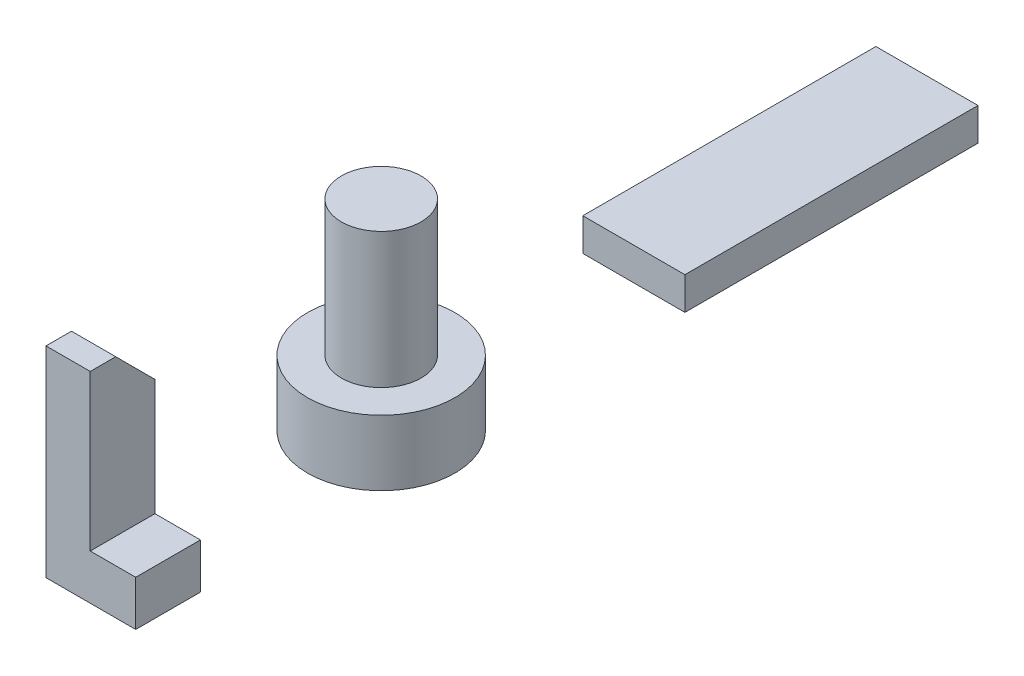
ISO-10303-21;
HEADER;
FILE_DESCRIPTION(('STEP AP214'),'2;1');
FILE_NAME('part.step','',(''),(''),'','','');
FILE_SCHEMA(('AUTOMOTIVE_DESIGN { 1 0 10303 214 1 1 1 1 }'));
ENDSEC;
DATA;
#1=APPLICATION_CONTEXT('core data for automotive mechanical design processes');
#2=APPLICATION_PROTOCOL_DEFINITION('international standard','automotive_design',2000,#1);
#3=PRODUCT_CONTEXT('',#1,'mechanical');
#4=PRODUCT('Part','Part','',(#3));
#5=PRODUCT_RELATED_PRODUCT_CATEGORY('part','',(#4));
#6=PRODUCT_DEFINITION_FORMATION('','',#4);
#7=PRODUCT_DEFINITION_CONTEXT('part definition',#1,'design');
#8=PRODUCT_DEFINITION('design','',#6,#7);
#9=PRODUCT_DEFINITION_SHAPE('','',#8);
#10=(LENGTH_UNIT() NAMED_UNIT(*) SI_UNIT(.MILLI.,.METRE.));
#11=(NAMED_UNIT(*) PLANE_ANGLE_UNIT() SI_UNIT($,.RADIAN.));
#12=(NAMED_UNIT(*) SI_UNIT($,.STERADIAN.) SOLID_ANGLE_UNIT());
#13=UNCERTAINTY_MEASURE_WITH_UNIT(LENGTH_MEASURE(1.E-05),#10,'distance_accuracy_value','');
#14=(GEOMETRIC_REPRESENTATION_CONTEXT(3) GLOBAL_UNCERTAINTY_ASSIGNED_CONTEXT((#13)) GLOBAL_UNIT_ASSIGNED_CONTEXT((#10,
#11,#12)) REPRESENTATION_CONTEXT('',''));
#15=CARTESIAN_POINT('',(0.,0.,0.));
#16=DIRECTION('',(0.,0.,1.));
#17=DIRECTION('',(1.,0.,0.));
#18=AXIS2_PLACEMENT_3D('',#15,#16,#17);
#19=CARTESIAN_POINT('',(-39.681812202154,12.7,-188.280978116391));
#20=DIRECTION('',(1.,0.,0.));
#21=DIRECTION('',(0.,0.,-1.));
#22=AXIS2_PLACEMENT_3D('',#19,#20,#21);
#23=PLANE('',#22);
#24=DIRECTION('',(0.,0.,1.));
#25=VECTOR('',#24,1.);
#26=CARTESIAN_POINT('',(-39.681812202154,0.,-188.280978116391));
#27=LINE('',#26,#25);
#28=CARTESIAN_POINT('',(-39.681812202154,0.,-302.173087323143));
#29=VERTEX_POINT('',#28);
#30=CARTESIAN_POINT('',(-39.681812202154,0.,-188.280978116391));
#31=VERTEX_POINT('',#30);
#32=EDGE_CURVE('E105',#29,#31,#27,.T.);
#33=ORIENTED_EDGE('',*,*,#32,.T.);
#34=DIRECTION('',(0.,-1.,0.));
#35=VECTOR('',#34,1.);
#36=CARTESIAN_POINT('',(-39.681812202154,12.7,-188.280978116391));
#37=LINE('',#36,#35);
#38=CARTESIAN_POINT('',(-39.681812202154,12.7,-188.280978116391));
#39=VERTEX_POINT('',#38);
#40=EDGE_CURVE('E12',#39,#31,#37,.T.);
#41=ORIENTED_EDGE('',*,*,#40,.F.);
#42=DIRECTION('',(0.,0.,1.));
#43=VECTOR('',#42,1.);
#44=CARTESIAN_POINT('',(-39.681812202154,12.7,-188.280978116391));
#45=LINE('',#44,#43);
#46=CARTESIAN_POINT('',(-39.681812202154,12.7,-302.173087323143));
#47=VERTEX_POINT('',#46);
#48=EDGE_CURVE('E93',#47,#39,#45,.T.);
#49=ORIENTED_EDGE('',*,*,#48,.F.);
#50=DIRECTION('',(0.,-1.,0.));
#51=VECTOR('',#50,1.);
#52=CARTESIAN_POINT('',(-39.681812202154,12.7,-302.173087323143));
#53=LINE('',#52,#51);
#54=EDGE_CURVE('E101',#47,#29,#53,.T.);
#55=ORIENTED_EDGE('',*,*,#54,.T.);
#56=EDGE_LOOP('',(#33,#41,#49,#55));
#57=FACE_BOUND('',#56,.T.);
#58=ADVANCED_FACE('F42',(#57),#23,.F.);
#59=CARTESIAN_POINT('',(-39.681812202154,12.7,-188.280978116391));
#60=DIRECTION('',(0.,0.,-1.));
#61=DIRECTION('',(-1.,0.,0.));
#62=AXIS2_PLACEMENT_3D('',#59,#60,#61);
#63=PLANE('',#62);
#64=DIRECTION('',(1.,0.,0.));
#65=VECTOR('',#64,1.);
#66=CARTESIAN_POINT('',(-39.681812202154,0.,-188.280978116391));
#67=LINE('',#66,#65);
#68=CARTESIAN_POINT('',(0.,0.,-188.280978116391));
#69=VERTEX_POINT('',#68);
#70=EDGE_CURVE('E97',#31,#69,#67,.T.);
#71=ORIENTED_EDGE('',*,*,#70,.T.);
#72=DIRECTION('',(0.,-1.,0.));
#73=VECTOR('',#72,1.);
#74=CARTESIAN_POINT('',(0.,12.7,-188.280978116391));
#75=LINE('',#74,#73);
#76=CARTESIAN_POINT('',(0.,12.7,-188.280978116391));
#77=VERTEX_POINT('',#76);
#78=EDGE_CURVE('E50',#77,#69,#75,.T.);
#79=ORIENTED_EDGE('',*,*,#78,.F.);
#80=DIRECTION('',(1.,0.,0.));
#81=VECTOR('',#80,1.);
#82=CARTESIAN_POINT('',(-39.681812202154,12.7,-188.280978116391));
#83=LINE('',#82,#81);
#84=EDGE_CURVE('E88',#39,#77,#83,.T.);
#85=ORIENTED_EDGE('',*,*,#84,.F.);
#86=ORIENTED_EDGE('',*,*,#40,.T.);
#87=EDGE_LOOP('',(#71,#79,#85,#86));
#88=FACE_BOUND('',#87,.T.);
#89=ADVANCED_FACE('F96',(#88),#63,.F.);
#90=CARTESIAN_POINT('',(0.,12.7,-188.280978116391));
#91=DIRECTION('',(-1.,0.,0.));
#92=DIRECTION('',(0.,0.,1.));
#93=AXIS2_PLACEMENT_3D('',#90,#91,#92);
#94=PLANE('',#93);
#95=DIRECTION('',(0.,0.,-1.));
#96=VECTOR('',#95,1.);
#97=CARTESIAN_POINT('',(0.,0.,-188.280978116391));
#98=LINE('',#97,#96);
#99=CARTESIAN_POINT('',(0.,0.,-302.173087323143));
#100=VERTEX_POINT('',#99);
#101=EDGE_CURVE('E75',#69,#100,#98,.T.);
#102=ORIENTED_EDGE('',*,*,#101,.T.);
#103=DIRECTION('',(0.,-1.,0.));
#104=VECTOR('',#103,1.);
#105=CARTESIAN_POINT('',(0.,12.7,-302.173087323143));
#106=LINE('',#105,#104);
#107=CARTESIAN_POINT('',(0.,12.7,-302.173087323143));
#108=VERTEX_POINT('',#107);
#109=EDGE_CURVE('E98',#108,#100,#106,.T.);
#110=ORIENTED_EDGE('',*,*,#109,.F.);
#111=DIRECTION('',(0.,0.,-1.));
#112=VECTOR('',#111,1.);
#113=CARTESIAN_POINT('',(0.,12.7,-188.280978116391));
#114=LINE('',#113,#112);
#115=EDGE_CURVE('E91',#77,#108,#114,.T.);
#116=ORIENTED_EDGE('',*,*,#115,.F.);
#117=ORIENTED_EDGE('',*,*,#78,.T.);
#118=EDGE_LOOP('',(#102,#110,#116,#117));
#119=FACE_BOUND('',#118,.T.);
#120=ADVANCED_FACE('F99',(#119),#94,.F.);
#121=CARTESIAN_POINT('',(-39.681812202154,12.7,-302.173087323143));
#122=DIRECTION('',(0.,0.,1.));
#123=DIRECTION('',(1.,0.,0.));
#124=AXIS2_PLACEMENT_3D('',#121,#122,#123);
#125=PLANE('',#124);
#126=DIRECTION('',(-1.,0.,0.));
#127=VECTOR('',#126,1.);
#128=CARTESIAN_POINT('',(-39.681812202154,0.,-302.173087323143));
#129=LINE('',#128,#127);
#130=EDGE_CURVE('E81',#100,#29,#129,.T.);
#131=ORIENTED_EDGE('',*,*,#130,.T.);
#132=ORIENTED_EDGE('',*,*,#54,.F.);
#133=DIRECTION('',(-1.,0.,0.));
#134=VECTOR('',#133,1.);
#135=CARTESIAN_POINT('',(-39.681812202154,12.7,-302.173087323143));
#136=LINE('',#135,#134);
#137=EDGE_CURVE('E58',#108,#47,#136,.T.);
#138=ORIENTED_EDGE('',*,*,#137,.F.);
#139=ORIENTED_EDGE('',*,*,#109,.T.);
#140=EDGE_LOOP('',(#131,#132,#138,#139));
#141=FACE_BOUND('',#140,.T.);
#142=ADVANCED_FACE('F112',(#141),#125,.F.);
#143=CARTESIAN_POINT('',(-39.681812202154,12.7,-302.173087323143));
#144=DIRECTION('',(0.,-1.,0.));
#145=DIRECTION('',(0.,0.,-1.));
#146=AXIS2_PLACEMENT_3D('',#143,#144,#145);
#147=PLANE('',#146);
#148=ORIENTED_EDGE('',*,*,#48,.T.);
#149=ORIENTED_EDGE('',*,*,#84,.T.);
#150=ORIENTED_EDGE('',*,*,#115,.T.);
#151=ORIENTED_EDGE('',*,*,#137,.T.);
#152=EDGE_LOOP('',(#148,#149,#150,#151));
#153=FACE_BOUND('',#152,.T.);
#154=ADVANCED_FACE('F89',(#153),#147,.F.);
#155=CARTESIAN_POINT('',(-39.681812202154,0.,-302.173087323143));
#156=DIRECTION('',(0.,-1.,0.));
#157=DIRECTION('',(0.,0.,-1.));
#158=AXIS2_PLACEMENT_3D('',#155,#156,#157);
#159=PLANE('',#158);
#160=ORIENTED_EDGE('',*,*,#32,.F.);
#161=ORIENTED_EDGE('',*,*,#130,.F.);
#162=ORIENTED_EDGE('',*,*,#101,.F.);
#163=ORIENTED_EDGE('',*,*,#70,.F.);
#164=EDGE_LOOP('',(#160,#161,#162,#163));
#165=FACE_BOUND('',#164,.T.);
#166=ADVANCED_FACE('F115',(#165),#159,.T.);
#167=CLOSED_SHELL('',(#58,#89,#120,#142,#154,#166));
#168=MANIFOLD_SOLID_BREP('B2',#167);
#169=CARTESIAN_POINT('',(-19.2388056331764,25.4,-89.4995244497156));
#170=DIRECTION('',(0.,1.,0.));
#171=DIRECTION('',(0.,0.,1.));
#172=AXIS2_PLACEMENT_3D('',#169,#170,#171);
#173=PLANE('',#172);
#174=CARTESIAN_POINT('',(-19.2388056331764,25.4,-89.4995244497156));
#175=DIRECTION('',(0.,1.,0.));
#176=DIRECTION('',(0.,0.,1.));
#177=AXIS2_PLACEMENT_3D('',#174,#175,#176);
#178=CIRCLE('',#177,28.650627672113);
#179=CARTESIAN_POINT('',(-19.2388056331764,25.4,-60.8488967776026));
#180=VERTEX_POINT('',#179);
#181=EDGE_CURVE('E41',#180,#180,#178,.T.);
#182=ORIENTED_EDGE('',*,*,#181,.T.);
#183=EDGE_LOOP('',(#182));
#184=FACE_BOUND('',#183,.T.);
#185=CARTESIAN_POINT('',(-19.2388056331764,25.4,-89.4995244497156));
#186=DIRECTION('',(0.,1.,0.));
#187=DIRECTION('',(0.,0.,1.));
#188=AXIS2_PLACEMENT_3D('',#185,#186,#187);
#189=CIRCLE('',#188,15.4812301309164);
#190=CARTESIAN_POINT('',(-19.2388056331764,25.4,-74.0182943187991));
#191=VERTEX_POINT('',#190);
#192=EDGE_CURVE('E188',#191,#191,#189,.T.);
#193=ORIENTED_EDGE('',*,*,#192,.F.);
#194=EDGE_LOOP('',(#193));
#195=FACE_BOUND('',#194,.T.);
#196=ADVANCED_FACE('F175',(#184,#195),#173,.T.);
#197=CARTESIAN_POINT('',(-19.2388056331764,25.4,-89.4995244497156));
#198=DIRECTION('',(0.,-1.,0.));
#199=DIRECTION('',(0.,0.,-1.));
#200=AXIS2_PLACEMENT_3D('',#197,#198,#199);
#201=CYLINDRICAL_SURFACE('',#200,28.650627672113);
#202=ORIENTED_EDGE('',*,*,#181,.F.);
#203=EDGE_LOOP('',(#202));
#204=FACE_BOUND('',#203,.T.);
#205=CARTESIAN_POINT('',(-19.2388056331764,0.,-89.4995244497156));
#206=DIRECTION('',(0.,1.,0.));
#207=DIRECTION('',(0.,0.,1.));
#208=AXIS2_PLACEMENT_3D('',#205,#206,#207);
#209=CIRCLE('',#208,28.650627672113);
#210=CARTESIAN_POINT('',(-19.2388056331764,0.,-60.8488967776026));
#211=VERTEX_POINT('',#210);
#212=EDGE_CURVE('E179',#211,#211,#209,.T.);
#213=ORIENTED_EDGE('',*,*,#212,.T.);
#214=EDGE_LOOP('',(#213));
#215=FACE_BOUND('',#214,.T.);
#216=ADVANCED_FACE('F177',(#204,#215),#201,.T.);
#217=CARTESIAN_POINT('',(-19.2388056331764,0.,-89.4995244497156));
#218=DIRECTION('',(0.,1.,0.));
#219=DIRECTION('',(0.,0.,1.));
#220=AXIS2_PLACEMENT_3D('',#217,#218,#219);
#221=PLANE('',#220);
#222=ORIENTED_EDGE('',*,*,#212,.F.);
#223=EDGE_LOOP('',(#222));
#224=FACE_BOUND('',#223,.T.);
#225=ADVANCED_FACE('F199',(#224),#221,.F.);
#226=CARTESIAN_POINT('',(-19.2388056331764,77.978,-89.4995244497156));
#227=DIRECTION('',(0.,-1.,0.));
#228=DIRECTION('',(0.,0.,-1.));
#229=AXIS2_PLACEMENT_3D('',#226,#227,#228);
#230=CYLINDRICAL_SURFACE('',#229,15.4812301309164);
#231=CARTESIAN_POINT('',(-19.2388056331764,77.978,-89.4995244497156));
#232=DIRECTION('',(0.,1.,0.));
#233=DIRECTION('',(0.,0.,1.));
#234=AXIS2_PLACEMENT_3D('',#231,#232,#233);
#235=CIRCLE('',#234,15.4812301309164);
#236=CARTESIAN_POINT('',(-19.2388056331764,77.978,-74.0182943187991));
#237=VERTEX_POINT('',#236);
#238=EDGE_CURVE('E186',#237,#237,#235,.T.);
#239=ORIENTED_EDGE('',*,*,#238,.F.);
#240=EDGE_LOOP('',(#239));
#241=FACE_BOUND('',#240,.T.);
#242=ORIENTED_EDGE('',*,*,#192,.T.);
#243=EDGE_LOOP('',(#242));
#244=FACE_BOUND('',#243,.T.);
#245=ADVANCED_FACE('F196',(#241,#244),#230,.T.);
#246=CARTESIAN_POINT('',(-19.2388056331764,77.978,-89.4995244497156));
#247=DIRECTION('',(0.,1.,0.));
#248=DIRECTION('',(0.,0.,1.));
#249=AXIS2_PLACEMENT_3D('',#246,#247,#248);
#250=PLANE('',#249);
#251=ORIENTED_EDGE('',*,*,#238,.T.);
#252=EDGE_LOOP('',(#251));
#253=FACE_BOUND('',#252,.T.);
#254=ADVANCED_FACE('F194',(#253),#250,.T.);
#255=CLOSED_SHELL('',(#196,#216,#225,#245,#254));
#256=MANIFOLD_SOLID_BREP('B6',#255);
#257=CARTESIAN_POINT('',(-34.8579529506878,0.,25.146));
#258=DIRECTION('',(0.,1.,0.));
#259=DIRECTION('',(0.,0.,1.));
#260=AXIS2_PLACEMENT_3D('',#257,#258,#259);
#261=PLANE('',#260);
#262=DIRECTION('',(1.,0.,0.));
#263=VECTOR('',#262,1.);
#264=CARTESIAN_POINT('',(-34.8579529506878,0.,0.));
#265=LINE('',#264,#263);
#266=CARTESIAN_POINT('',(-34.8579529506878,0.,0.));
#267=VERTEX_POINT('',#266);
#268=CARTESIAN_POINT('',(0.,0.,0.));
#269=VERTEX_POINT('',#268);
#270=EDGE_CURVE('E327',#267,#269,#265,.T.);
#271=ORIENTED_EDGE('',*,*,#270,.T.);
#272=DIRECTION('',(0.,0.,-1.));
#273=VECTOR('',#272,1.);
#274=CARTESIAN_POINT('',(0.,0.,25.146));
#275=LINE('',#274,#273);
#276=CARTESIAN_POINT('',(0.,0.,25.146));
#277=VERTEX_POINT('',#276);
#278=EDGE_CURVE('E308',#277,#269,#275,.T.);
#279=ORIENTED_EDGE('',*,*,#278,.F.);
#280=DIRECTION('',(1.,0.,0.));
#281=VECTOR('',#280,1.);
#282=CARTESIAN_POINT('',(-34.8579529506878,0.,25.146));
#283=LINE('',#282,#281);
#284=CARTESIAN_POINT('',(-34.8579529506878,0.,25.146));
#285=VERTEX_POINT('',#284);
#286=EDGE_CURVE('E315',#285,#277,#283,.T.);
#287=ORIENTED_EDGE('',*,*,#286,.F.);
#288=DIRECTION('',(0.,0.,-1.));
#289=VECTOR('',#288,1.);
#290=CARTESIAN_POINT('',(-34.8579529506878,0.,25.146));
#291=LINE('',#290,#289);
#292=EDGE_CURVE('E343',#285,#267,#291,.T.);
#293=ORIENTED_EDGE('',*,*,#292,.T.);
#294=EDGE_LOOP('',(#271,#279,#287,#293));
#295=FACE_BOUND('',#294,.T.);
#296=ADVANCED_FACE('F246',(#295),#261,.F.);
#297=CARTESIAN_POINT('',(0.,0.,25.146));
#298=DIRECTION('',(-1.,0.,0.));
#299=DIRECTION('',(0.,0.,1.));
#300=AXIS2_PLACEMENT_3D('',#297,#298,#299);
#301=PLANE('',#300);
#302=DIRECTION('',(0.,1.,0.));
#303=VECTOR('',#302,1.);
#304=CARTESIAN_POINT('',(0.,0.,0.));
#305=LINE('',#304,#303);
#306=CARTESIAN_POINT('',(0.,17.5754617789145,0.));
#307=VERTEX_POINT('',#306);
#308=EDGE_CURVE('E350',#269,#307,#305,.T.);
#309=ORIENTED_EDGE('',*,*,#308,.T.);
#310=DIRECTION('',(0.,0.,-1.));
#311=VECTOR('',#310,1.);
#312=CARTESIAN_POINT('',(0.,17.5754617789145,25.146));
#313=LINE('',#312,#311);
#314=CARTESIAN_POINT('',(0.,17.5754617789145,25.146));
#315=VERTEX_POINT('',#314);
#316=EDGE_CURVE('E311',#315,#307,#313,.T.);
#317=ORIENTED_EDGE('',*,*,#316,.F.);
#318=DIRECTION('',(0.,1.,0.));
#319=VECTOR('',#318,1.);
#320=CARTESIAN_POINT('',(0.,0.,25.146));
#321=LINE('',#320,#319);
#322=EDGE_CURVE('E304',#277,#315,#321,.T.);
#323=ORIENTED_EDGE('',*,*,#322,.F.);
#324=ORIENTED_EDGE('',*,*,#278,.T.);
#325=EDGE_LOOP('',(#309,#317,#323,#324));
#326=FACE_BOUND('',#325,.T.);
#327=ADVANCED_FACE('F306',(#326),#301,.F.);
#328=CARTESIAN_POINT('',(0.,17.5754617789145,25.146));
#329=DIRECTION('',(0.,-1.,0.));
#330=DIRECTION('',(0.,0.,-1.));
#331=AXIS2_PLACEMENT_3D('',#328,#329,#330);
#332=PLANE('',#331);
#333=DIRECTION('',(-1.,0.,0.));
#334=VECTOR('',#333,1.);
#335=CARTESIAN_POINT('',(0.,17.5754617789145,0.));
#336=LINE('',#335,#334);
#337=CARTESIAN_POINT('',(-17.6686169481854,17.5754617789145,0.));
#338=VERTEX_POINT('',#337);
#339=EDGE_CURVE('E348',#307,#338,#336,.T.);
#340=ORIENTED_EDGE('',*,*,#339,.T.);
#341=DIRECTION('',(0.,0.,-1.));
#342=VECTOR('',#341,1.);
#343=CARTESIAN_POINT('',(-17.6686169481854,17.5754617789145,25.146));
#344=LINE('',#343,#342);
#345=CARTESIAN_POINT('',(-17.6686169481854,17.5754617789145,25.146));
#346=VERTEX_POINT('',#345);
#347=EDGE_CURVE('E332',#346,#338,#344,.T.);
#348=ORIENTED_EDGE('',*,*,#347,.F.);
#349=DIRECTION('',(-1.,0.,0.));
#350=VECTOR('',#349,1.);
#351=CARTESIAN_POINT('',(0.,17.5754617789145,25.146));
#352=LINE('',#351,#350);
#353=EDGE_CURVE('E314',#315,#346,#352,.T.);
#354=ORIENTED_EDGE('',*,*,#353,.F.);
#355=ORIENTED_EDGE('',*,*,#316,.T.);
#356=EDGE_LOOP('',(#340,#348,#354,#355));
#357=FACE_BOUND('',#356,.T.);
#358=ADVANCED_FACE('F362',(#357),#332,.F.);
#359=CARTESIAN_POINT('',(-17.6686169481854,17.5754617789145,25.146));
#360=DIRECTION('',(-1.,0.,0.));
#361=DIRECTION('',(0.,0.,1.));
#362=AXIS2_PLACEMENT_3D('',#359,#360,#361);
#363=PLANE('',#362);
#364=DIRECTION('',(0.,1.,0.));
#365=VECTOR('',#364,1.);
#366=CARTESIAN_POINT('',(-17.6686169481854,17.5754617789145,0.));
#367=LINE('',#366,#365);
#368=CARTESIAN_POINT('',(-17.6686169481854,62.7748195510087,0.));
#369=VERTEX_POINT('',#368);
#370=EDGE_CURVE('E346',#338,#369,#367,.T.);
#371=ORIENTED_EDGE('',*,*,#370,.T.);
#372=DIRECTION('',(0.,-0.707106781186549,-0.707106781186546));
#373=VECTOR('',#372,1.);
#374=CARTESIAN_POINT('',(-17.6686169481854,78.0148195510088,15.24));
#375=LINE('',#374,#373);
#376=CARTESIAN_POINT('',(-17.6686169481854,78.0148195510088,15.24));
#377=VERTEX_POINT('',#376);
#378=EDGE_CURVE('E173',#369,#377,#375,.F.);
#379=ORIENTED_EDGE('',*,*,#378,.T.);
#380=DIRECTION('',(0.,0.,-1.));
#381=VECTOR('',#380,1.);
#382=CARTESIAN_POINT('',(-17.6686169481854,78.0148195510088,25.146));
#383=LINE('',#382,#381);
#384=CARTESIAN_POINT('',(-17.6686169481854,78.0148195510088,25.146));
#385=VERTEX_POINT('',#384);
#386=EDGE_CURVE('E338',#385,#377,#383,.T.);
#387=ORIENTED_EDGE('',*,*,#386,.F.);
#388=DIRECTION('',(0.,1.,0.));
#389=VECTOR('',#388,1.);
#390=CARTESIAN_POINT('',(-17.6686169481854,17.5754617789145,25.146));
#391=LINE('',#390,#389);
#392=EDGE_CURVE('E356',#346,#385,#391,.T.);
#393=ORIENTED_EDGE('',*,*,#392,.F.);
#394=ORIENTED_EDGE('',*,*,#347,.T.);
#395=EDGE_LOOP('',(#371,#379,#387,#393,#394));
#396=FACE_BOUND('',#395,.T.);
#397=ADVANCED_FACE('F365',(#396),#363,.F.);
#398=CARTESIAN_POINT('',(-17.6686169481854,78.0148195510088,25.146));
#399=DIRECTION('',(0.,-1.,0.));
#400=DIRECTION('',(0.,0.,-1.));
#401=AXIS2_PLACEMENT_3D('',#398,#399,#400);
#402=PLANE('',#401);
#403=ORIENTED_EDGE('',*,*,#386,.T.);
#404=DIRECTION('',(-1.,0.,0.));
#405=VECTOR('',#404,1.);
#406=CARTESIAN_POINT('',(-17.6686169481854,78.0148195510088,15.24));
#407=LINE('',#406,#405);
#408=CARTESIAN_POINT('',(-34.8579529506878,78.0148195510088,15.24));
#409=VERTEX_POINT('',#408);
#410=EDGE_CURVE('E328',#377,#409,#407,.T.);
#411=ORIENTED_EDGE('',*,*,#410,.T.);
#412=DIRECTION('',(0.,0.,-1.));
#413=VECTOR('',#412,1.);
#414=CARTESIAN_POINT('',(-34.8579529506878,78.0148195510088,25.146));
#415=LINE('',#414,#413);
#416=CARTESIAN_POINT('',(-34.8579529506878,78.0148195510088,25.146));
#417=VERTEX_POINT('',#416);
#418=EDGE_CURVE('E341',#417,#409,#415,.T.);
#419=ORIENTED_EDGE('',*,*,#418,.F.);
#420=DIRECTION('',(-1.,0.,0.));
#421=VECTOR('',#420,1.);
#422=CARTESIAN_POINT('',(-17.6686169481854,78.0148195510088,25.146));
#423=LINE('',#422,#421);
#424=EDGE_CURVE('E354',#385,#417,#423,.T.);
#425=ORIENTED_EDGE('',*,*,#424,.F.);
#426=EDGE_LOOP('',(#403,#411,#419,#425));
#427=FACE_BOUND('',#426,.T.);
#428=ADVANCED_FACE('F371',(#427),#402,.F.);
#429=CARTESIAN_POINT('',(-34.8579529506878,78.0148195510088,25.146));
#430=DIRECTION('',(1.,0.,0.));
#431=DIRECTION('',(0.,1.,0.));
#432=AXIS2_PLACEMENT_3D('',#429,#430,#431);
#433=PLANE('',#432);
#434=ORIENTED_EDGE('',*,*,#418,.T.);
#435=DIRECTION('',(0.,0.707106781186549,0.707106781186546));
#436=VECTOR('',#435,1.);
#437=CARTESIAN_POINT('',(-34.8579529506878,78.0148195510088,15.24));
#438=LINE('',#437,#436);
#439=CARTESIAN_POINT('',(-34.8579529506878,62.7748195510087,0.));
#440=VERTEX_POINT('',#439);
#441=EDGE_CURVE('E268',#409,#440,#438,.F.);
#442=ORIENTED_EDGE('',*,*,#441,.T.);
#443=DIRECTION('',(0.,-1.,0.));
#444=VECTOR('',#443,1.);
#445=CARTESIAN_POINT('',(-34.8579529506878,78.0148195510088,0.));
#446=LINE('',#445,#444);
#447=EDGE_CURVE('E324',#440,#267,#446,.T.);
#448=ORIENTED_EDGE('',*,*,#447,.T.);
#449=ORIENTED_EDGE('',*,*,#292,.F.);
#450=DIRECTION('',(0.,-1.,0.));
#451=VECTOR('',#450,1.);
#452=CARTESIAN_POINT('',(-34.8579529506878,78.0148195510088,25.146));
#453=LINE('',#452,#451);
#454=EDGE_CURVE('E320',#417,#285,#453,.T.);
#455=ORIENTED_EDGE('',*,*,#454,.F.);
#456=EDGE_LOOP('',(#434,#442,#448,#449,#455));
#457=FACE_BOUND('',#456,.T.);
#458=ADVANCED_FACE('F372',(#457),#433,.F.);
#459=CARTESIAN_POINT('',(0.,0.,25.146));
#460=DIRECTION('',(0.,0.,1.));
#461=DIRECTION('',(1.,0.,0.));
#462=AXIS2_PLACEMENT_3D('',#459,#460,#461);
#463=PLANE('',#462);
#464=ORIENTED_EDGE('',*,*,#286,.T.);
#465=ORIENTED_EDGE('',*,*,#322,.T.);
#466=ORIENTED_EDGE('',*,*,#353,.T.);
#467=ORIENTED_EDGE('',*,*,#392,.T.);
#468=ORIENTED_EDGE('',*,*,#424,.T.);
#469=ORIENTED_EDGE('',*,*,#454,.T.);
#470=EDGE_LOOP('',(#464,#465,#466,#467,#468,#469));
#471=FACE_BOUND('',#470,.T.);
#472=ADVANCED_FACE('F318',(#471),#463,.T.);
#473=CARTESIAN_POINT('',(0.,0.,0.));
#474=DIRECTION('',(0.,0.,1.));
#475=DIRECTION('',(1.,0.,0.));
#476=AXIS2_PLACEMENT_3D('',#473,#474,#475);
#477=PLANE('',#476);
#478=ORIENTED_EDGE('',*,*,#447,.F.);
#479=DIRECTION('',(1.,0.,0.));
#480=VECTOR('',#479,1.);
#481=CARTESIAN_POINT('',(0.,62.7748195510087,0.));
#482=LINE('',#481,#480);
#483=EDGE_CURVE('E254',#440,#369,#482,.T.);
#484=ORIENTED_EDGE('',*,*,#483,.T.);
#485=ORIENTED_EDGE('',*,*,#370,.F.);
#486=ORIENTED_EDGE('',*,*,#339,.F.);
#487=ORIENTED_EDGE('',*,*,#308,.F.);
#488=ORIENTED_EDGE('',*,*,#270,.F.);
#489=EDGE_LOOP('',(#478,#484,#485,#486,#487,#488));
#490=FACE_BOUND('',#489,.T.);
#491=ADVANCED_FACE('F373',(#490),#477,.F.);
#492=CARTESIAN_POINT('',(-17.6686169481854,78.0148195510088,15.24));
#493=DIRECTION('',(0.,-0.707106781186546,0.707106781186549));
#494=DIRECTION('',(0.,-0.707106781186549,-0.707106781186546));
#495=AXIS2_PLACEMENT_3D('',#492,#493,#494);
#496=PLANE('',#495);
#497=ORIENTED_EDGE('',*,*,#378,.F.);
#498=ORIENTED_EDGE('',*,*,#483,.F.);
#499=ORIENTED_EDGE('',*,*,#441,.F.);
#500=ORIENTED_EDGE('',*,*,#410,.F.);
#501=EDGE_LOOP('',(#497,#498,#499,#500));
#502=FACE_BOUND('',#501,.T.);
#503=ADVANCED_FACE('F248',(#502),#496,.F.);
#504=CLOSED_SHELL('',(#296,#327,#358,#397,#428,#458,#472,#491,#503));
#505=MANIFOLD_SOLID_BREP('B36',#504);
#506=ADVANCED_BREP_SHAPE_REPRESENTATION('',(#18,#168,#256,#505),#14);
#507=SHAPE_DEFINITION_REPRESENTATION(#9,#506);
ENDSEC;
END-ISO-10303-21;
